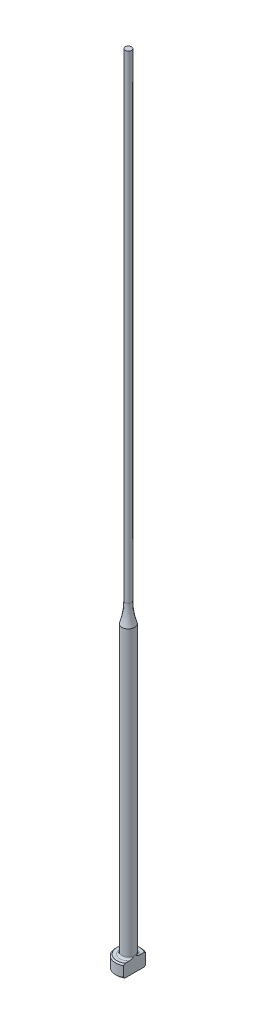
from build123d import *
from build123d.topology import SkipClean

# Parameters (mm, degrees)
CHAMFER1_SIZE = 0.2
FILLET1_R     = 0.3
KEY_DEPTH     = 126.031995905


with BuildPart() as part:
    # Sketch1 → Revolve1 (revolve)
    with BuildSketch(Plane.XY, mode=Mode.PRIVATE) as revolve1_sk:
        with BuildLine():
            Line((0, 0), (-2, 0))
            Line((-2, 0), (-2, 2))
            Line((-2, 2), (-1, 2))
            Line((-1, 2), (-1, 46.877501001))
            ThreePointArc((-1, 46.877501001), (-0.625791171, 48.41886117), (-0.5, 50))
            Line((-0.5, 50), (-0.5, 125))
            Line((-0.5, 125), (0, 125))
            Line((0, 125), (0, 0))
        make_face()
    revolve(revolve1_sk.sketch.rotate(Axis((0, 259.958771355, 0), (0, -1, 0)), 270), axis=Axis((0, 259.958771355, 0), (0, -1, 0)))

    # Chamfer1
    chamfer1_edges = [part.edges().sort_by_distance(p)[0] for p in [
        (0, 0, -2),
        (0, 2, -2),
    ]]
    chamfer(chamfer1_edges, length=CHAMFER1_SIZE)

    # Fillet1
    fillet1_edges = [part.edges().sort_by_distance(p)[0] for p in [
        (0, 2, -1),
    ]]
    fillet(fillet1_edges, radius=FILLET1_R)

    # Sketch2 → KEY (cut, through all)
    with SkipClean():  # the faces are left unmerged after this step: merging them gives an invalid solid
        with BuildSketch(Plane(origin=(0, 0, 0), x_dir=(1, 0, 0), z_dir=(0, 1, 0))):
            with BuildLine():
                Line((1, 1.732050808), (1, -1.732050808))
                ThreePointArc((1, -1.732050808), (2, 0), (1, 1.732050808))
            make_face()
        extrude(amount=KEY_DEPTH, mode=Mode.SUBTRACT)


solid = part.part
